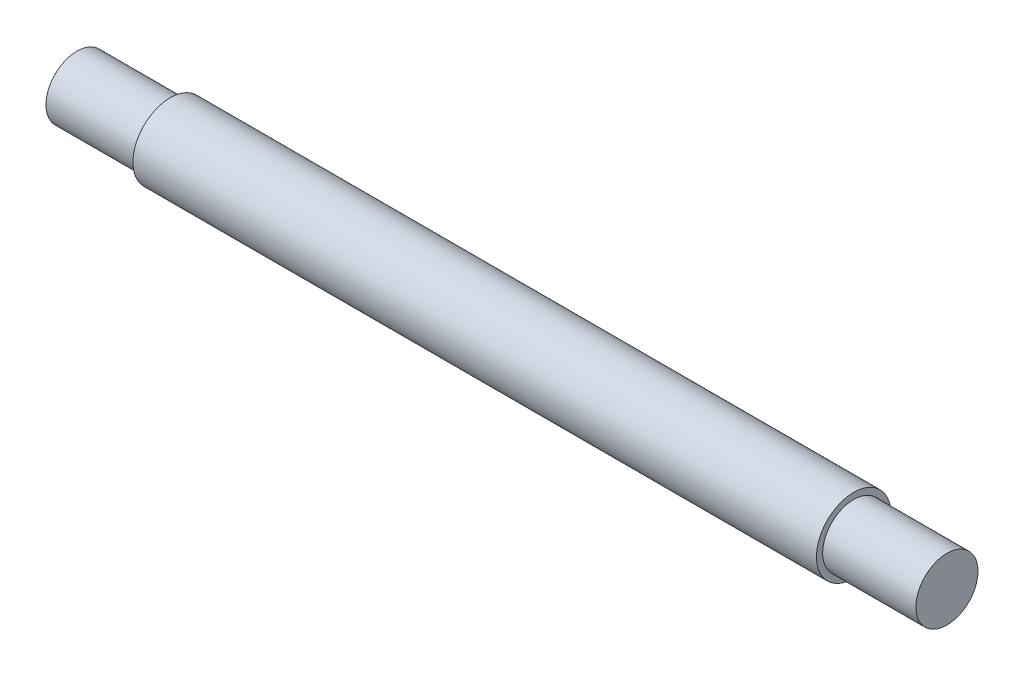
ISO-10303-21;
HEADER;
FILE_DESCRIPTION(('STEP AP214'),'2;1');
FILE_NAME('part.step','',(''),(''),'','','');
FILE_SCHEMA(('AUTOMOTIVE_DESIGN { 1 0 10303 214 1 1 1 1 }'));
ENDSEC;
DATA;
#1=APPLICATION_CONTEXT('core data for automotive mechanical design processes');
#2=APPLICATION_PROTOCOL_DEFINITION('international standard','automotive_design',2000,#1);
#3=PRODUCT_CONTEXT('',#1,'mechanical');
#4=PRODUCT('Part','Part','',(#3));
#5=PRODUCT_RELATED_PRODUCT_CATEGORY('part','',(#4));
#6=PRODUCT_DEFINITION_FORMATION('','',#4);
#7=PRODUCT_DEFINITION_CONTEXT('part definition',#1,'design');
#8=PRODUCT_DEFINITION('design','',#6,#7);
#9=PRODUCT_DEFINITION_SHAPE('','',#8);
#10=(LENGTH_UNIT() NAMED_UNIT(*) SI_UNIT(.MILLI.,.METRE.));
#11=(NAMED_UNIT(*) PLANE_ANGLE_UNIT() SI_UNIT($,.RADIAN.));
#12=(NAMED_UNIT(*) SI_UNIT($,.STERADIAN.) SOLID_ANGLE_UNIT());
#13=UNCERTAINTY_MEASURE_WITH_UNIT(LENGTH_MEASURE(1.E-05),#10,'distance_accuracy_value','');
#14=(GEOMETRIC_REPRESENTATION_CONTEXT(3) GLOBAL_UNCERTAINTY_ASSIGNED_CONTEXT((#13)) GLOBAL_UNIT_ASSIGNED_CONTEXT((#10,
#11,#12)) REPRESENTATION_CONTEXT('',''));
#15=CARTESIAN_POINT('',(0.,0.,0.));
#16=DIRECTION('',(0.,0.,1.));
#17=DIRECTION('',(1.,0.,0.));
#18=AXIS2_PLACEMENT_3D('',#15,#16,#17);
#19=CARTESIAN_POINT('',(0.,4.99999999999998,0.));
#20=DIRECTION('',(1.,0.,0.));
#21=DIRECTION('',(0.,0.,-1.00000000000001));
#22=AXIS2_PLACEMENT_3D('',#19,#20,#21);
#23=PLANE('',#22);
#24=CARTESIAN_POINT('',(0.,0.,0.));
#25=DIRECTION('',(1.,0.,0.));
#26=DIRECTION('',(0.,0.,-1.00000000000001));
#27=AXIS2_PLACEMENT_3D('',#24,#25,#26);
#28=CIRCLE('',#27,4.99999999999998);
#29=CARTESIAN_POINT('',(0.,0.,-5.00000000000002));
#30=VERTEX_POINT('',#29);
#31=EDGE_CURVE('E61',#30,#30,#28,.T.);
#32=ORIENTED_EDGE('',*,*,#31,.T.);
#33=EDGE_LOOP('',(#32));
#34=FACE_BOUND('',#33,.T.);
#35=ADVANCED_FACE('F39',(#34),#23,.T.);
#36=CARTESIAN_POINT('',(-140.,0.,0.));
#37=DIRECTION('',(-1.,0.,0.));
#38=DIRECTION('',(0.,0.,1.00000000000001));
#39=AXIS2_PLACEMENT_3D('',#36,#37,#38);
#40=PLANE('',#39);
#41=CARTESIAN_POINT('',(-140.,0.,0.));
#42=DIRECTION('',(1.,0.,0.));
#43=DIRECTION('',(0.,0.,-1.00000000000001));
#44=AXIS2_PLACEMENT_3D('',#41,#42,#43);
#45=CIRCLE('',#44,4.99999999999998);
#46=CARTESIAN_POINT('',(-140.,0.,-5.00000000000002));
#47=VERTEX_POINT('',#46);
#48=EDGE_CURVE('E12',#47,#47,#45,.T.);
#49=ORIENTED_EDGE('',*,*,#48,.F.);
#50=EDGE_LOOP('',(#49));
#51=FACE_BOUND('',#50,.T.);
#52=ADVANCED_FACE('F78',(#51),#40,.T.);
#53=CARTESIAN_POINT('',(0.,0.,0.));
#54=DIRECTION('',(1.,0.,0.));
#55=DIRECTION('',(0.,0.,-1.00000000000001));
#56=AXIS2_PLACEMENT_3D('',#53,#54,#55);
#57=CYLINDRICAL_SURFACE('',#56,4.99999999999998);
#58=ORIENTED_EDGE('',*,*,#48,.T.);
#59=EDGE_LOOP('',(#58));
#60=FACE_BOUND('',#59,.T.);
#61=CARTESIAN_POINT('',(-125.,0.,0.));
#62=DIRECTION('',(1.,0.,0.));
#63=DIRECTION('',(0.,0.,-1.00000000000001));
#64=AXIS2_PLACEMENT_3D('',#61,#62,#63);
#65=CIRCLE('',#64,4.99999999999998);
#66=CARTESIAN_POINT('',(-125.,0.,-5.00000000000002));
#67=VERTEX_POINT('',#66);
#68=EDGE_CURVE('E45',#67,#67,#65,.T.);
#69=ORIENTED_EDGE('',*,*,#68,.F.);
#70=EDGE_LOOP('',(#69));
#71=FACE_BOUND('',#70,.T.);
#72=ADVANCED_FACE('F82',(#60,#71),#57,.T.);
#73=CARTESIAN_POINT('',(-125.,4.99999999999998,0.));
#74=DIRECTION('',(-1.,0.,0.));
#75=DIRECTION('',(0.,0.,1.00000000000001));
#76=AXIS2_PLACEMENT_3D('',#73,#74,#75);
#77=PLANE('',#76);
#78=ORIENTED_EDGE('',*,*,#68,.T.);
#79=EDGE_LOOP('',(#78));
#80=FACE_BOUND('',#79,.T.);
#81=CARTESIAN_POINT('',(-125.,0.,0.));
#82=DIRECTION('',(1.,0.,0.));
#83=DIRECTION('',(0.,0.,-1.00000000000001));
#84=AXIS2_PLACEMENT_3D('',#81,#82,#83);
#85=CIRCLE('',#84,5.99999999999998);
#86=CARTESIAN_POINT('',(-125.,0.,-6.00000000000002));
#87=VERTEX_POINT('',#86);
#88=EDGE_CURVE('E49',#87,#87,#85,.T.);
#89=ORIENTED_EDGE('',*,*,#88,.F.);
#90=EDGE_LOOP('',(#89));
#91=FACE_BOUND('',#90,.T.);
#92=ADVANCED_FACE('F87',(#80,#91),#77,.T.);
#93=CARTESIAN_POINT('',(0.,0.,0.));
#94=DIRECTION('',(1.,0.,0.));
#95=DIRECTION('',(0.,0.,-1.00000000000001));
#96=AXIS2_PLACEMENT_3D('',#93,#94,#95);
#97=CYLINDRICAL_SURFACE('',#96,5.99999999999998);
#98=ORIENTED_EDGE('',*,*,#88,.T.);
#99=EDGE_LOOP('',(#98));
#100=FACE_BOUND('',#99,.T.);
#101=CARTESIAN_POINT('',(-15.,0.,0.));
#102=DIRECTION('',(1.,0.,0.));
#103=DIRECTION('',(0.,0.,-1.00000000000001));
#104=AXIS2_PLACEMENT_3D('',#101,#102,#103);
#105=CIRCLE('',#104,5.99999999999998);
#106=CARTESIAN_POINT('',(-15.,0.,-6.00000000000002));
#107=VERTEX_POINT('',#106);
#108=EDGE_CURVE('E53',#107,#107,#105,.T.);
#109=ORIENTED_EDGE('',*,*,#108,.F.);
#110=EDGE_LOOP('',(#109));
#111=FACE_BOUND('',#110,.T.);
#112=ADVANCED_FACE('F74',(#100,#111),#97,.T.);
#113=CARTESIAN_POINT('',(-15.,5.99999999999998,0.));
#114=DIRECTION('',(1.,0.,0.));
#115=DIRECTION('',(0.,0.,-1.00000000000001));
#116=AXIS2_PLACEMENT_3D('',#113,#114,#115);
#117=PLANE('',#116);
#118=ORIENTED_EDGE('',*,*,#108,.T.);
#119=EDGE_LOOP('',(#118));
#120=FACE_BOUND('',#119,.T.);
#121=CARTESIAN_POINT('',(-15.,0.,0.));
#122=DIRECTION('',(1.,0.,0.));
#123=DIRECTION('',(0.,0.,-1.00000000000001));
#124=AXIS2_PLACEMENT_3D('',#121,#122,#123);
#125=CIRCLE('',#124,4.99999999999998);
#126=CARTESIAN_POINT('',(-15.,0.,-5.00000000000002));
#127=VERTEX_POINT('',#126);
#128=EDGE_CURVE('E58',#127,#127,#125,.T.);
#129=ORIENTED_EDGE('',*,*,#128,.F.);
#130=EDGE_LOOP('',(#129));
#131=FACE_BOUND('',#130,.T.);
#132=ADVANCED_FACE('F68',(#120,#131),#117,.T.);
#133=CARTESIAN_POINT('',(0.,0.,0.));
#134=DIRECTION('',(1.,0.,0.));
#135=DIRECTION('',(0.,0.,-1.00000000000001));
#136=AXIS2_PLACEMENT_3D('',#133,#134,#135);
#137=CYLINDRICAL_SURFACE('',#136,4.99999999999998);
#138=ORIENTED_EDGE('',*,*,#128,.T.);
#139=EDGE_LOOP('',(#138));
#140=FACE_BOUND('',#139,.T.);
#141=ORIENTED_EDGE('',*,*,#31,.F.);
#142=EDGE_LOOP('',(#141));
#143=FACE_BOUND('',#142,.T.);
#144=ADVANCED_FACE('F66',(#140,#143),#137,.T.);
#145=CLOSED_SHELL('',(#35,#52,#72,#92,#112,#132,#144));
#146=MANIFOLD_SOLID_BREP('B2',#145);
#147=ADVANCED_BREP_SHAPE_REPRESENTATION('',(#18,#146),#14);
#148=SHAPE_DEFINITION_REPRESENTATION(#9,#147);
ENDSEC;
END-ISO-10303-21;
